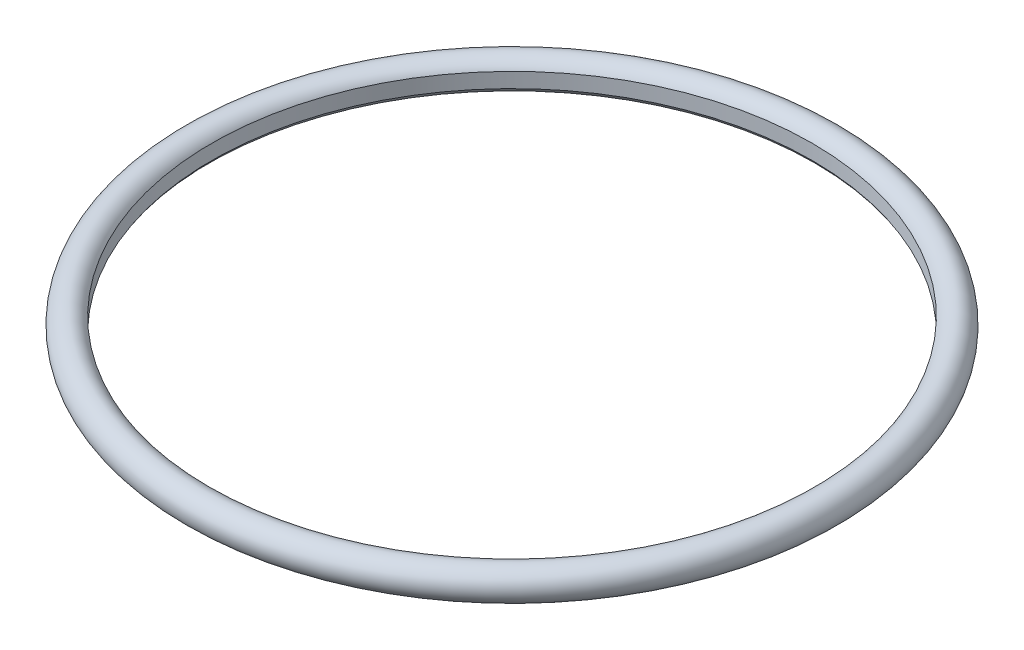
ISO-10303-21;
HEADER;
FILE_DESCRIPTION(('STEP AP214'),'2;1');
FILE_NAME('part.step','',(''),(''),'','','');
FILE_SCHEMA(('AUTOMOTIVE_DESIGN { 1 0 10303 214 1 1 1 1 }'));
ENDSEC;
DATA;
#1=APPLICATION_CONTEXT('core data for automotive mechanical design processes');
#2=APPLICATION_PROTOCOL_DEFINITION('international standard','automotive_design',2000,#1);
#3=PRODUCT_CONTEXT('',#1,'mechanical');
#4=PRODUCT('Part','Part','',(#3));
#5=PRODUCT_RELATED_PRODUCT_CATEGORY('part','',(#4));
#6=PRODUCT_DEFINITION_FORMATION('','',#4);
#7=PRODUCT_DEFINITION_CONTEXT('part definition',#1,'design');
#8=PRODUCT_DEFINITION('design','',#6,#7);
#9=PRODUCT_DEFINITION_SHAPE('','',#8);
#10=(LENGTH_UNIT() NAMED_UNIT(*) SI_UNIT(.MILLI.,.METRE.));
#11=(NAMED_UNIT(*) PLANE_ANGLE_UNIT() SI_UNIT($,.RADIAN.));
#12=(NAMED_UNIT(*) SI_UNIT($,.STERADIAN.) SOLID_ANGLE_UNIT());
#13=UNCERTAINTY_MEASURE_WITH_UNIT(LENGTH_MEASURE(1.E-05),#10,'distance_accuracy_value','');
#14=(GEOMETRIC_REPRESENTATION_CONTEXT(3) GLOBAL_UNCERTAINTY_ASSIGNED_CONTEXT((#13)) GLOBAL_UNIT_ASSIGNED_CONTEXT((#10,
#11,#12)) REPRESENTATION_CONTEXT('',''));
#15=CARTESIAN_POINT('',(0.,0.,0.));
#16=DIRECTION('',(0.,0.,1.));
#17=DIRECTION('',(1.,0.,0.));
#18=AXIS2_PLACEMENT_3D('',#15,#16,#17);
#19=CARTESIAN_POINT('',(0.,0.,0.));
#20=DIRECTION('',(0.,-1.,0.));
#21=DIRECTION('',(0.,0.,-1.));
#22=AXIS2_PLACEMENT_3D('',#19,#20,#21);
#23=TOROIDAL_SURFACE('',#22,25.,1.25);
#24=CARTESIAN_POINT('',(0.,0.593717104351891,0.));
#25=DIRECTION('',(0.,-1.,0.));
#26=DIRECTION('',(0.,0.,-1.));
#27=AXIS2_PLACEMENT_3D('',#24,#25,#26);
#28=CIRCLE('',#27,23.9);
#29=CARTESIAN_POINT('',(0.,0.593717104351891,-23.9));
#30=VERTEX_POINT('',#29);
#31=EDGE_CURVE('E10',#30,#30,#28,.T.);
#32=ORIENTED_EDGE('',*,*,#31,.T.);
#33=EDGE_LOOP('',(#32));
#34=FACE_BOUND('',#33,.T.);
#35=CARTESIAN_POINT('',(0.,-0.593717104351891,0.));
#36=DIRECTION('',(0.,-1.,0.));
#37=DIRECTION('',(0.,0.,-1.));
#38=AXIS2_PLACEMENT_3D('',#35,#36,#37);
#39=CIRCLE('',#38,23.9);
#40=CARTESIAN_POINT('',(0.,-0.593717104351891,-23.9));
#41=VERTEX_POINT('',#40);
#42=EDGE_CURVE('E43',#41,#41,#39,.T.);
#43=ORIENTED_EDGE('',*,*,#42,.F.);
#44=EDGE_LOOP('',(#43));
#45=FACE_BOUND('',#44,.T.);
#46=ADVANCED_FACE('F37',(#34,#45),#23,.T.);
#47=CARTESIAN_POINT('',(0.,0.,0.));
#48=DIRECTION('',(0.,-1.,0.));
#49=DIRECTION('',(0.,0.,-1.));
#50=AXIS2_PLACEMENT_3D('',#47,#48,#49);
#51=CYLINDRICAL_SURFACE('',#50,23.9);
#52=ORIENTED_EDGE('',*,*,#42,.T.);
#53=EDGE_LOOP('',(#52));
#54=FACE_BOUND('',#53,.T.);
#55=ORIENTED_EDGE('',*,*,#31,.F.);
#56=EDGE_LOOP('',(#55));
#57=FACE_BOUND('',#56,.T.);
#58=ADVANCED_FACE('F49',(#54,#57),#51,.F.);
#59=CLOSED_SHELL('',(#46,#58));
#60=MANIFOLD_SOLID_BREP('B2',#59);
#61=ADVANCED_BREP_SHAPE_REPRESENTATION('',(#18,#60),#14);
#62=SHAPE_DEFINITION_REPRESENTATION(#9,#61);
ENDSEC;
END-ISO-10303-21;
